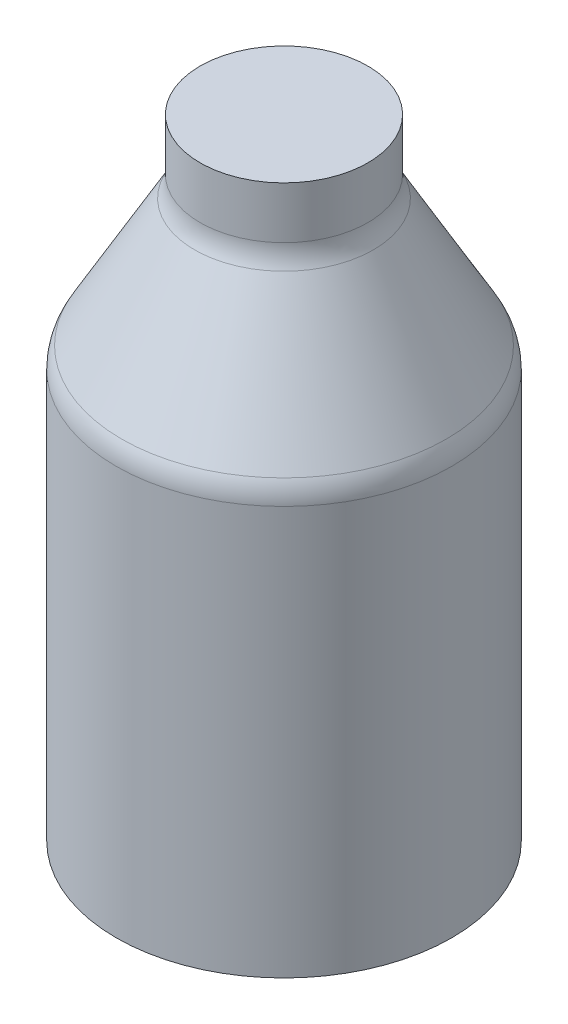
ISO-10303-21;
HEADER;
FILE_DESCRIPTION(('STEP AP214'),'2;1');
FILE_NAME('part.step','',(''),(''),'','','');
FILE_SCHEMA(('AUTOMOTIVE_DESIGN { 1 0 10303 214 1 1 1 1 }'));
ENDSEC;
DATA;
#1=APPLICATION_CONTEXT('core data for automotive mechanical design processes');
#2=APPLICATION_PROTOCOL_DEFINITION('international standard','automotive_design',2000,#1);
#3=PRODUCT_CONTEXT('',#1,'mechanical');
#4=PRODUCT('Part','Part','',(#3));
#5=PRODUCT_RELATED_PRODUCT_CATEGORY('part','',(#4));
#6=PRODUCT_DEFINITION_FORMATION('','',#4);
#7=PRODUCT_DEFINITION_CONTEXT('part definition',#1,'design');
#8=PRODUCT_DEFINITION('design','',#6,#7);
#9=PRODUCT_DEFINITION_SHAPE('','',#8);
#10=(LENGTH_UNIT() NAMED_UNIT(*) SI_UNIT(.MILLI.,.METRE.));
#11=(NAMED_UNIT(*) PLANE_ANGLE_UNIT() SI_UNIT($,.RADIAN.));
#12=(NAMED_UNIT(*) SI_UNIT($,.STERADIAN.) SOLID_ANGLE_UNIT());
#13=UNCERTAINTY_MEASURE_WITH_UNIT(LENGTH_MEASURE(1.E-05),#10,'distance_accuracy_value','');
#14=(GEOMETRIC_REPRESENTATION_CONTEXT(3) GLOBAL_UNCERTAINTY_ASSIGNED_CONTEXT((#13)) GLOBAL_UNIT_ASSIGNED_CONTEXT((#10,
#11,#12)) REPRESENTATION_CONTEXT('',''));
#15=CARTESIAN_POINT('',(0.,0.,0.));
#16=DIRECTION('',(0.,0.,1.));
#17=DIRECTION('',(1.,0.,0.));
#18=AXIS2_PLACEMENT_3D('',#15,#16,#17);
#19=CARTESIAN_POINT('',(0.,0.,0.));
#20=DIRECTION('',(0.,-1.,0.));
#21=DIRECTION('',(1.,0.,0.));
#22=AXIS2_PLACEMENT_3D('',#19,#20,#21);
#23=PLANE('',#22);
#24=CARTESIAN_POINT('',(0.,0.,0.));
#25=DIRECTION('',(0.,1.,0.));
#26=DIRECTION('',(-1.,0.,0.));
#27=AXIS2_PLACEMENT_3D('',#24,#25,#26);
#28=CIRCLE('',#27,40.);
#29=CARTESIAN_POINT('',(-40.,0.,0.));
#30=VERTEX_POINT('',#29);
#31=EDGE_CURVE('E51',#30,#30,#28,.T.);
#32=ORIENTED_EDGE('',*,*,#31,.F.);
#33=EDGE_LOOP('',(#32));
#34=FACE_BOUND('',#33,.T.);
#35=ADVANCED_FACE('F31',(#34),#23,.T.);
#36=CARTESIAN_POINT('',(0.,150.,0.));
#37=DIRECTION('',(0.,1.,0.));
#38=DIRECTION('',(-1.,0.,0.));
#39=AXIS2_PLACEMENT_3D('',#36,#37,#38);
#40=CYLINDRICAL_SURFACE('',#39,40.);
#41=CARTESIAN_POINT('',(0.,97.3443556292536,0.));
#42=DIRECTION('',(0.,-1.,0.));
#43=DIRECTION('',(1.,0.,0.));
#44=AXIS2_PLACEMENT_3D('',#41,#42,#43);
#45=CIRCLE('',#44,40.);
#46=CARTESIAN_POINT('',(40.,97.3443556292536,0.));
#47=VERTEX_POINT('',#46);
#48=EDGE_CURVE('E10',#47,#47,#45,.T.);
#49=ORIENTED_EDGE('',*,*,#48,.T.);
#50=EDGE_LOOP('',(#49));
#51=FACE_BOUND('',#50,.T.);
#52=ORIENTED_EDGE('',*,*,#31,.T.);
#53=EDGE_LOOP('',(#52));
#54=FACE_BOUND('',#53,.T.);
#55=ADVANCED_FACE('F71',(#51,#54),#40,.T.);
#56=CARTESIAN_POINT('',(0.,135.,0.));
#57=DIRECTION('',(0.,-1.,0.));
#58=DIRECTION('',(1.,0.,0.));
#59=AXIS2_PLACEMENT_3D('',#56,#57,#58);
#60=CONICAL_SURFACE('',#59,20.,0.519146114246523);
#61=CARTESIAN_POINT('',(0.,132.694254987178,0.));
#62=DIRECTION('',(0.,-1.,0.));
#63=DIRECTION('',(1.,0.,0.));
#64=AXIS2_PLACEMENT_3D('',#61,#62,#63);
#65=CIRCLE('',#64,21.3175685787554);
#66=CARTESIAN_POINT('',(21.3175685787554,132.694254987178,0.));
#67=VERTEX_POINT('',#66);
#68=EDGE_CURVE('E38',#67,#67,#65,.T.);
#69=ORIENTED_EDGE('',*,*,#68,.T.);
#70=EDGE_LOOP('',(#69));
#71=FACE_BOUND('',#70,.T.);
#72=CARTESIAN_POINT('',(0.,102.305745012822,0.));
#73=DIRECTION('',(0.,1.,0.));
#74=DIRECTION('',(-1.,0.,0.));
#75=AXIS2_PLACEMENT_3D('',#72,#73,#74);
#76=CIRCLE('',#75,38.6824314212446);
#77=CARTESIAN_POINT('',(-38.6824314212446,102.305745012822,0.));
#78=VERTEX_POINT('',#77);
#79=EDGE_CURVE('E42',#78,#78,#76,.T.);
#80=ORIENTED_EDGE('',*,*,#79,.T.);
#81=EDGE_LOOP('',(#80));
#82=FACE_BOUND('',#81,.T.);
#83=ADVANCED_FACE('F62',(#71,#82),#60,.T.);
#84=CARTESIAN_POINT('',(0.,150.,0.));
#85=DIRECTION('',(0.,1.,0.));
#86=DIRECTION('',(-1.,0.,0.));
#87=AXIS2_PLACEMENT_3D('',#84,#85,#86);
#88=CYLINDRICAL_SURFACE('',#87,20.);
#89=CARTESIAN_POINT('',(0.,137.655644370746,0.));
#90=DIRECTION('',(0.,1.,0.));
#91=DIRECTION('',(-1.,0.,0.));
#92=AXIS2_PLACEMENT_3D('',#89,#90,#91);
#93=CIRCLE('',#92,20.);
#94=CARTESIAN_POINT('',(-20.,137.655644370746,0.));
#95=VERTEX_POINT('',#94);
#96=EDGE_CURVE('E46',#95,#95,#93,.T.);
#97=ORIENTED_EDGE('',*,*,#96,.T.);
#98=EDGE_LOOP('',(#97));
#99=FACE_BOUND('',#98,.T.);
#100=CARTESIAN_POINT('',(0.,150.,0.));
#101=DIRECTION('',(0.,1.,0.));
#102=DIRECTION('',(-1.,0.,0.));
#103=AXIS2_PLACEMENT_3D('',#100,#101,#102);
#104=CIRCLE('',#103,20.);
#105=CARTESIAN_POINT('',(-20.,150.,0.));
#106=VERTEX_POINT('',#105);
#107=EDGE_CURVE('E54',#106,#106,#104,.T.);
#108=ORIENTED_EDGE('',*,*,#107,.F.);
#109=EDGE_LOOP('',(#108));
#110=FACE_BOUND('',#109,.T.);
#111=ADVANCED_FACE('F60',(#99,#110),#88,.T.);
#112=CARTESIAN_POINT('',(-20.,150.,0.));
#113=DIRECTION('',(0.,1.,0.));
#114=DIRECTION('',(-1.,0.,0.));
#115=AXIS2_PLACEMENT_3D('',#112,#113,#114);
#116=PLANE('',#115);
#117=ORIENTED_EDGE('',*,*,#107,.T.);
#118=EDGE_LOOP('',(#117));
#119=FACE_BOUND('',#118,.T.);
#120=ADVANCED_FACE('F58',(#119),#116,.T.);
#121=CARTESIAN_POINT('',(0.,137.655644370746,0.));
#122=DIRECTION('',(0.,1.,0.));
#123=DIRECTION('',(-1.,0.,0.));
#124=AXIS2_PLACEMENT_3D('',#121,#122,#123);
#125=TOROIDAL_SURFACE('',#124,30.,10.);
#126=ORIENTED_EDGE('',*,*,#68,.F.);
#127=EDGE_LOOP('',(#126));
#128=FACE_BOUND('',#127,.T.);
#129=ORIENTED_EDGE('',*,*,#96,.F.);
#130=EDGE_LOOP('',(#129));
#131=FACE_BOUND('',#130,.T.);
#132=ADVANCED_FACE('F69',(#128,#131),#125,.F.);
#133=CARTESIAN_POINT('',(0.,97.3443556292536,0.));
#134=DIRECTION('',(0.,-1.,0.));
#135=DIRECTION('',(1.,0.,0.));
#136=AXIS2_PLACEMENT_3D('',#133,#134,#135);
#137=TOROIDAL_SURFACE('',#136,30.,10.);
#138=ORIENTED_EDGE('',*,*,#48,.F.);
#139=EDGE_LOOP('',(#138));
#140=FACE_BOUND('',#139,.T.);
#141=ORIENTED_EDGE('',*,*,#79,.F.);
#142=EDGE_LOOP('',(#141));
#143=FACE_BOUND('',#142,.T.);
#144=ADVANCED_FACE('F33',(#140,#143),#137,.T.);
#145=CLOSED_SHELL('',(#35,#55,#83,#111,#120,#132,#144));
#146=MANIFOLD_SOLID_BREP('B2',#145);
#147=ADVANCED_BREP_SHAPE_REPRESENTATION('',(#18,#146),#14);
#148=SHAPE_DEFINITION_REPRESENTATION(#9,#147);
ENDSEC;
END-ISO-10303-21;
